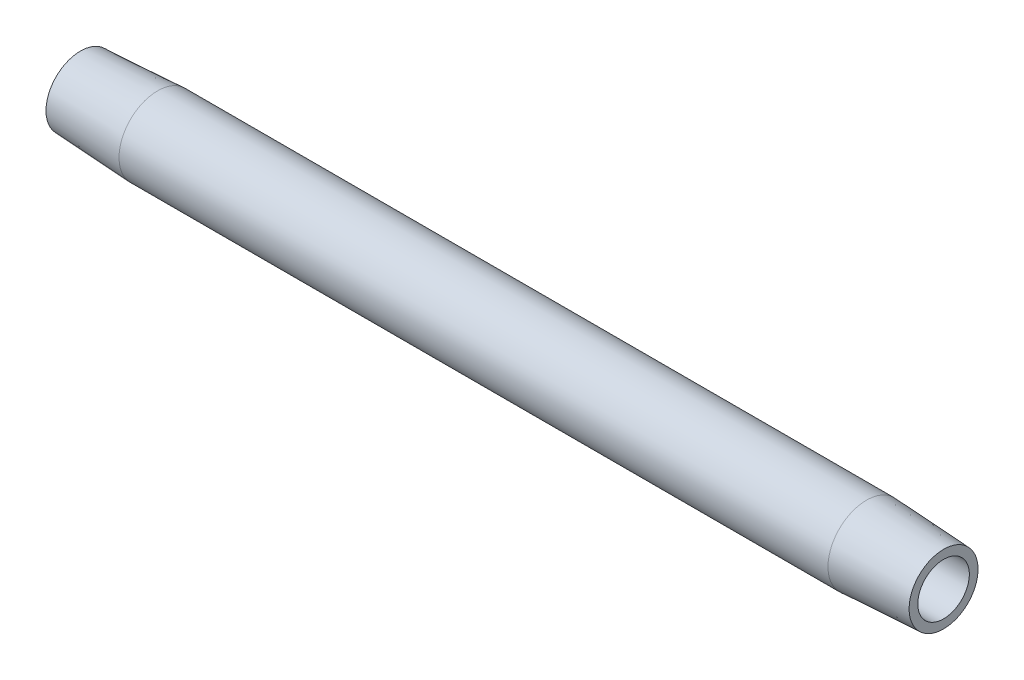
from build123d import *


with BuildPart() as part:
    # Sketch2 → Revolve1 (revolve)
    with BuildSketch(Plane.XY, mode=Mode.PRIVATE) as revolve1_sk:
        Polygon((7.9375, 3.96875), (0, 3.552763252), (0, 2.6543), (88.9, 2.6543), (88.9, 3.552763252), (80.9625, 3.96875), align=None)
    revolve(revolve1_sk.sketch.rotate(Axis((0.476141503, 0, 0), (1, 0, 0)), 90), axis=Axis((0.476141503, 0, 0), (1, 0, 0)))


solid = part.part
